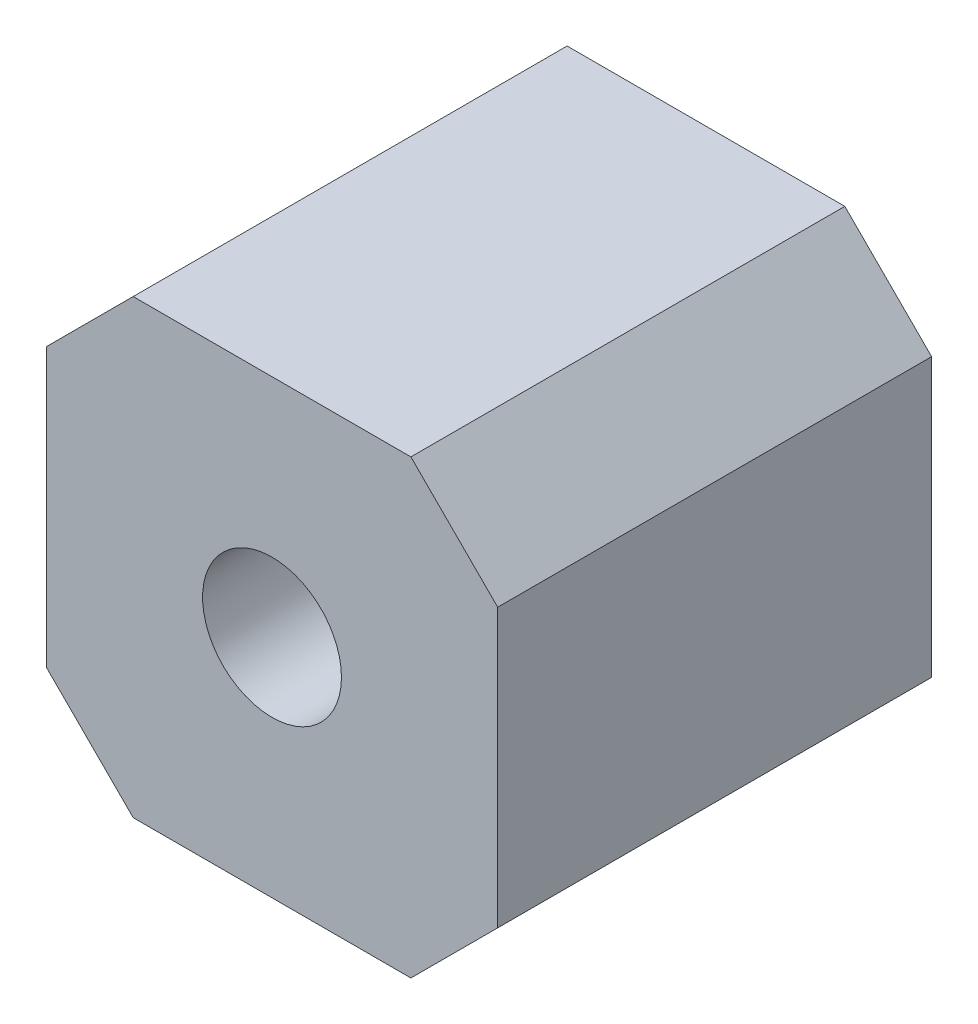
ISO-10303-21;
HEADER;
FILE_DESCRIPTION(('STEP AP214'),'2;1');
FILE_NAME('part.step','',(''),(''),'','','');
FILE_SCHEMA(('AUTOMOTIVE_DESIGN { 1 0 10303 214 1 1 1 1 }'));
ENDSEC;
DATA;
#1=APPLICATION_CONTEXT('core data for automotive mechanical design processes');
#2=APPLICATION_PROTOCOL_DEFINITION('international standard','automotive_design',2000,#1);
#3=PRODUCT_CONTEXT('',#1,'mechanical');
#4=PRODUCT('Part','Part','',(#3));
#5=PRODUCT_RELATED_PRODUCT_CATEGORY('part','',(#4));
#6=PRODUCT_DEFINITION_FORMATION('','',#4);
#7=PRODUCT_DEFINITION_CONTEXT('part definition',#1,'design');
#8=PRODUCT_DEFINITION('design','',#6,#7);
#9=PRODUCT_DEFINITION_SHAPE('','',#8);
#10=(LENGTH_UNIT() NAMED_UNIT(*) SI_UNIT(.MILLI.,.METRE.));
#11=(NAMED_UNIT(*) PLANE_ANGLE_UNIT() SI_UNIT($,.RADIAN.));
#12=(NAMED_UNIT(*) SI_UNIT($,.STERADIAN.) SOLID_ANGLE_UNIT());
#13=UNCERTAINTY_MEASURE_WITH_UNIT(LENGTH_MEASURE(1.E-05),#10,'distance_accuracy_value','');
#14=(GEOMETRIC_REPRESENTATION_CONTEXT(3) GLOBAL_UNCERTAINTY_ASSIGNED_CONTEXT((#13)) GLOBAL_UNIT_ASSIGNED_CONTEXT((#10,
#11,#12)) REPRESENTATION_CONTEXT('',''));
#15=CARTESIAN_POINT('',(0.,0.,0.));
#16=DIRECTION('',(0.,0.,1.));
#17=DIRECTION('',(1.,0.,0.));
#18=AXIS2_PLACEMENT_3D('',#15,#16,#17);
#19=CARTESIAN_POINT('',(-13.,13.,25.));
#20=DIRECTION('',(0.,0.,-1.));
#21=DIRECTION('',(-1.,0.,0.));
#22=AXIS2_PLACEMENT_3D('',#19,#20,#21);
#23=PLANE('',#22);
#24=DIRECTION('',(-1.,0.,0.));
#25=VECTOR('',#24,1.);
#26=CARTESIAN_POINT('',(-8.,13.,25.));
#27=LINE('',#26,#25);
#28=CARTESIAN_POINT('',(8.,13.,25.));
#29=VERTEX_POINT('',#28);
#30=CARTESIAN_POINT('',(-8.,13.,25.));
#31=VERTEX_POINT('',#30);
#32=EDGE_CURVE('E452',#29,#31,#27,.T.);
#33=ORIENTED_EDGE('',*,*,#32,.T.);
#34=DIRECTION('',(-0.707106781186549,-0.707106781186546,0.));
#35=VECTOR('',#34,1.);
#36=CARTESIAN_POINT('',(-13.,8.00000000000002,25.));
#37=LINE('',#36,#35);
#38=CARTESIAN_POINT('',(-13.,8.00000000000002,25.));
#39=VERTEX_POINT('',#38);
#40=EDGE_CURVE('E429',#31,#39,#37,.T.);
#41=ORIENTED_EDGE('',*,*,#40,.T.);
#42=DIRECTION('',(0.,-1.,0.));
#43=VECTOR('',#42,1.);
#44=CARTESIAN_POINT('',(-13.,8.00000000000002,25.));
#45=LINE('',#44,#43);
#46=CARTESIAN_POINT('',(-13.,-8.,25.));
#47=VERTEX_POINT('',#46);
#48=EDGE_CURVE('E455',#39,#47,#45,.T.);
#49=ORIENTED_EDGE('',*,*,#48,.T.);
#50=DIRECTION('',(0.707106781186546,-0.707106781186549,0.));
#51=VECTOR('',#50,1.);
#52=CARTESIAN_POINT('',(-13.,-8.,25.));
#53=LINE('',#52,#51);
#54=CARTESIAN_POINT('',(-8.00000000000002,-13.,25.));
#55=VERTEX_POINT('',#54);
#56=EDGE_CURVE('E457',#47,#55,#53,.T.);
#57=ORIENTED_EDGE('',*,*,#56,.T.);
#58=DIRECTION('',(1.,0.,0.));
#59=VECTOR('',#58,1.);
#60=CARTESIAN_POINT('',(-8.00000000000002,-13.,25.));
#61=LINE('',#60,#59);
#62=CARTESIAN_POINT('',(8.,-13.,25.));
#63=VERTEX_POINT('',#62);
#64=EDGE_CURVE('E459',#55,#63,#61,.T.);
#65=ORIENTED_EDGE('',*,*,#64,.T.);
#66=DIRECTION('',(0.707106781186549,0.707106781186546,0.));
#67=VECTOR('',#66,1.);
#68=CARTESIAN_POINT('',(8.,-13.,25.));
#69=LINE('',#68,#67);
#70=CARTESIAN_POINT('',(13.,-8.00000000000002,25.));
#71=VERTEX_POINT('',#70);
#72=EDGE_CURVE('E461',#63,#71,#69,.T.);
#73=ORIENTED_EDGE('',*,*,#72,.T.);
#74=DIRECTION('',(0.,1.,0.));
#75=VECTOR('',#74,1.);
#76=CARTESIAN_POINT('',(13.,8.00000000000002,25.));
#77=LINE('',#76,#75);
#78=CARTESIAN_POINT('',(13.,8.00000000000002,25.));
#79=VERTEX_POINT('',#78);
#80=EDGE_CURVE('E370',#71,#79,#77,.T.);
#81=ORIENTED_EDGE('',*,*,#80,.T.);
#82=DIRECTION('',(-0.707106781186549,0.707106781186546,0.));
#83=VECTOR('',#82,1.);
#84=CARTESIAN_POINT('',(8.,13.,25.));
#85=LINE('',#84,#83);
#86=EDGE_CURVE('E365',#79,#29,#85,.T.);
#87=ORIENTED_EDGE('',*,*,#86,.T.);
#88=EDGE_LOOP('',(#33,#41,#49,#57,#65,#73,#81,#87));
#89=FACE_BOUND('',#88,.T.);
#90=CARTESIAN_POINT('',(0.,0.,25.));
#91=DIRECTION('',(0.,0.,1.));
#92=DIRECTION('',(1.,0.,0.));
#93=AXIS2_PLACEMENT_3D('',#90,#91,#92);
#94=CIRCLE('',#93,4.);
#95=CARTESIAN_POINT('',(4.,0.,25.));
#96=VERTEX_POINT('',#95);
#97=EDGE_CURVE('E434',#96,#96,#94,.T.);
#98=ORIENTED_EDGE('',*,*,#97,.F.);
#99=EDGE_LOOP('',(#98));
#100=FACE_BOUND('',#99,.T.);
#101=ADVANCED_FACE('F350',(#89,#100),#23,.F.);
#102=CARTESIAN_POINT('',(-13.,13.,0.));
#103=DIRECTION('',(0.,0.,-1.));
#104=DIRECTION('',(-1.,0.,0.));
#105=AXIS2_PLACEMENT_3D('',#102,#103,#104);
#106=PLANE('',#105);
#107=DIRECTION('',(-1.,0.,0.));
#108=VECTOR('',#107,1.);
#109=CARTESIAN_POINT('',(-8.,13.,0.));
#110=LINE('',#109,#108);
#111=CARTESIAN_POINT('',(8.,13.,0.));
#112=VERTEX_POINT('',#111);
#113=CARTESIAN_POINT('',(-8.,13.,0.));
#114=VERTEX_POINT('',#113);
#115=EDGE_CURVE('E420',#112,#114,#110,.T.);
#116=ORIENTED_EDGE('',*,*,#115,.F.);
#117=DIRECTION('',(-0.707106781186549,0.707106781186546,0.));
#118=VECTOR('',#117,1.);
#119=CARTESIAN_POINT('',(8.,13.,0.));
#120=LINE('',#119,#118);
#121=CARTESIAN_POINT('',(13.,8.00000000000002,0.));
#122=VERTEX_POINT('',#121);
#123=EDGE_CURVE('E450',#122,#112,#120,.T.);
#124=ORIENTED_EDGE('',*,*,#123,.F.);
#125=DIRECTION('',(0.,1.,0.));
#126=VECTOR('',#125,1.);
#127=CARTESIAN_POINT('',(13.,8.00000000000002,0.));
#128=LINE('',#127,#126);
#129=CARTESIAN_POINT('',(13.,-8.00000000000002,0.));
#130=VERTEX_POINT('',#129);
#131=EDGE_CURVE('E448',#130,#122,#128,.T.);
#132=ORIENTED_EDGE('',*,*,#131,.F.);
#133=DIRECTION('',(0.707106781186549,0.707106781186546,0.));
#134=VECTOR('',#133,1.);
#135=CARTESIAN_POINT('',(8.,-13.,0.));
#136=LINE('',#135,#134);
#137=CARTESIAN_POINT('',(8.,-13.,0.));
#138=VERTEX_POINT('',#137);
#139=EDGE_CURVE('E446',#138,#130,#136,.T.);
#140=ORIENTED_EDGE('',*,*,#139,.F.);
#141=DIRECTION('',(1.,0.,0.));
#142=VECTOR('',#141,1.);
#143=CARTESIAN_POINT('',(-8.00000000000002,-13.,0.));
#144=LINE('',#143,#142);
#145=CARTESIAN_POINT('',(-8.00000000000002,-13.,0.));
#146=VERTEX_POINT('',#145);
#147=EDGE_CURVE('E444',#146,#138,#144,.T.);
#148=ORIENTED_EDGE('',*,*,#147,.F.);
#149=DIRECTION('',(0.707106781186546,-0.707106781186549,0.));
#150=VECTOR('',#149,1.);
#151=CARTESIAN_POINT('',(-13.,-8.,0.));
#152=LINE('',#151,#150);
#153=CARTESIAN_POINT('',(-13.,-8.,0.));
#154=VERTEX_POINT('',#153);
#155=EDGE_CURVE('E442',#154,#146,#152,.T.);
#156=ORIENTED_EDGE('',*,*,#155,.F.);
#157=DIRECTION('',(0.,-1.,0.));
#158=VECTOR('',#157,1.);
#159=CARTESIAN_POINT('',(-13.,8.00000000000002,0.));
#160=LINE('',#159,#158);
#161=CARTESIAN_POINT('',(-13.,8.00000000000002,0.));
#162=VERTEX_POINT('',#161);
#163=EDGE_CURVE('E422',#162,#154,#160,.T.);
#164=ORIENTED_EDGE('',*,*,#163,.F.);
#165=DIRECTION('',(-0.707106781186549,-0.707106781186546,0.));
#166=VECTOR('',#165,1.);
#167=CARTESIAN_POINT('',(-13.,8.00000000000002,0.));
#168=LINE('',#167,#166);
#169=EDGE_CURVE('E415',#114,#162,#168,.T.);
#170=ORIENTED_EDGE('',*,*,#169,.F.);
#171=EDGE_LOOP('',(#116,#124,#132,#140,#148,#156,#164,#170));
#172=FACE_BOUND('',#171,.T.);
#173=CARTESIAN_POINT('',(0.,0.,0.));
#174=DIRECTION('',(0.,0.,1.));
#175=DIRECTION('',(1.,0.,0.));
#176=AXIS2_PLACEMENT_3D('',#173,#174,#175);
#177=CIRCLE('',#176,4.);
#178=CARTESIAN_POINT('',(4.,0.,0.));
#179=VERTEX_POINT('',#178);
#180=EDGE_CURVE('E437',#179,#179,#177,.T.);
#181=ORIENTED_EDGE('',*,*,#180,.T.);
#182=EDGE_LOOP('',(#181));
#183=FACE_BOUND('',#182,.T.);
#184=ADVANCED_FACE('F416',(#172,#183),#106,.T.);
#185=CARTESIAN_POINT('',(-8.,13.,25.));
#186=DIRECTION('',(0.,-1.,0.));
#187=DIRECTION('',(0.,0.,-1.));
#188=AXIS2_PLACEMENT_3D('',#185,#186,#187);
#189=PLANE('',#188);
#190=ORIENTED_EDGE('',*,*,#115,.T.);
#191=DIRECTION('',(0.,0.,-1.));
#192=VECTOR('',#191,1.);
#193=CARTESIAN_POINT('',(-8.,13.,25.));
#194=LINE('',#193,#192);
#195=EDGE_CURVE('E11',#31,#114,#194,.T.);
#196=ORIENTED_EDGE('',*,*,#195,.F.);
#197=ORIENTED_EDGE('',*,*,#32,.F.);
#198=DIRECTION('',(0.,0.,-1.));
#199=VECTOR('',#198,1.);
#200=CARTESIAN_POINT('',(8.,13.,25.));
#201=LINE('',#200,#199);
#202=EDGE_CURVE('E433',#29,#112,#201,.T.);
#203=ORIENTED_EDGE('',*,*,#202,.T.);
#204=EDGE_LOOP('',(#190,#196,#197,#203));
#205=FACE_BOUND('',#204,.T.);
#206=ADVANCED_FACE('F352',(#205),#189,.F.);
#207=CARTESIAN_POINT('',(-13.,8.00000000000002,25.));
#208=DIRECTION('',(0.707106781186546,-0.707106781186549,0.));
#209=DIRECTION('',(0.707106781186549,0.707106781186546,0.));
#210=AXIS2_PLACEMENT_3D('',#207,#208,#209);
#211=PLANE('',#210);
#212=ORIENTED_EDGE('',*,*,#169,.T.);
#213=DIRECTION('',(0.,0.,-1.));
#214=VECTOR('',#213,1.);
#215=CARTESIAN_POINT('',(-13.,8.00000000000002,25.));
#216=LINE('',#215,#214);
#217=EDGE_CURVE('E358',#39,#162,#216,.T.);
#218=ORIENTED_EDGE('',*,*,#217,.F.);
#219=ORIENTED_EDGE('',*,*,#40,.F.);
#220=ORIENTED_EDGE('',*,*,#195,.T.);
#221=EDGE_LOOP('',(#212,#218,#219,#220));
#222=FACE_BOUND('',#221,.T.);
#223=ADVANCED_FACE('F428',(#222),#211,.F.);
#224=CARTESIAN_POINT('',(-13.,8.00000000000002,25.));
#225=DIRECTION('',(1.,0.,0.));
#226=DIRECTION('',(0.,1.,0.));
#227=AXIS2_PLACEMENT_3D('',#224,#225,#226);
#228=PLANE('',#227);
#229=ORIENTED_EDGE('',*,*,#163,.T.);
#230=DIRECTION('',(0.,0.,-1.));
#231=VECTOR('',#230,1.);
#232=CARTESIAN_POINT('',(-13.,-8.,25.));
#233=LINE('',#232,#231);
#234=EDGE_CURVE('E478',#47,#154,#233,.T.);
#235=ORIENTED_EDGE('',*,*,#234,.F.);
#236=ORIENTED_EDGE('',*,*,#48,.F.);
#237=ORIENTED_EDGE('',*,*,#217,.T.);
#238=EDGE_LOOP('',(#229,#235,#236,#237));
#239=FACE_BOUND('',#238,.T.);
#240=ADVANCED_FACE('F482',(#239),#228,.F.);
#241=CARTESIAN_POINT('',(-13.,-8.,25.));
#242=DIRECTION('',(0.707106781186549,0.707106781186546,0.));
#243=DIRECTION('',(-0.707106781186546,0.707106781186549,0.));
#244=AXIS2_PLACEMENT_3D('',#241,#242,#243);
#245=PLANE('',#244);
#246=ORIENTED_EDGE('',*,*,#155,.T.);
#247=DIRECTION('',(0.,0.,-1.));
#248=VECTOR('',#247,1.);
#249=CARTESIAN_POINT('',(-8.00000000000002,-13.,25.));
#250=LINE('',#249,#248);
#251=EDGE_CURVE('E475',#55,#146,#250,.T.);
#252=ORIENTED_EDGE('',*,*,#251,.F.);
#253=ORIENTED_EDGE('',*,*,#56,.F.);
#254=ORIENTED_EDGE('',*,*,#234,.T.);
#255=EDGE_LOOP('',(#246,#252,#253,#254));
#256=FACE_BOUND('',#255,.T.);
#257=ADVANCED_FACE('F490',(#256),#245,.F.);
#258=CARTESIAN_POINT('',(-8.00000000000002,-13.,25.));
#259=DIRECTION('',(0.,1.,0.));
#260=DIRECTION('',(0.,0.,1.));
#261=AXIS2_PLACEMENT_3D('',#258,#259,#260);
#262=PLANE('',#261);
#263=ORIENTED_EDGE('',*,*,#147,.T.);
#264=DIRECTION('',(0.,0.,-1.));
#265=VECTOR('',#264,1.);
#266=CARTESIAN_POINT('',(8.,-13.,25.));
#267=LINE('',#266,#265);
#268=EDGE_CURVE('E472',#63,#138,#267,.T.);
#269=ORIENTED_EDGE('',*,*,#268,.F.);
#270=ORIENTED_EDGE('',*,*,#64,.F.);
#271=ORIENTED_EDGE('',*,*,#251,.T.);
#272=EDGE_LOOP('',(#263,#269,#270,#271));
#273=FACE_BOUND('',#272,.T.);
#274=ADVANCED_FACE('F493',(#273),#262,.F.);
#275=CARTESIAN_POINT('',(8.,-13.,25.));
#276=DIRECTION('',(-0.707106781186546,0.707106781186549,0.));
#277=DIRECTION('',(-0.707106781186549,-0.707106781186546,0.));
#278=AXIS2_PLACEMENT_3D('',#275,#276,#277);
#279=PLANE('',#278);
#280=ORIENTED_EDGE('',*,*,#139,.T.);
#281=DIRECTION('',(0.,0.,-1.));
#282=VECTOR('',#281,1.);
#283=CARTESIAN_POINT('',(13.,-8.00000000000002,25.));
#284=LINE('',#283,#282);
#285=EDGE_CURVE('E469',#71,#130,#284,.T.);
#286=ORIENTED_EDGE('',*,*,#285,.F.);
#287=ORIENTED_EDGE('',*,*,#72,.F.);
#288=ORIENTED_EDGE('',*,*,#268,.T.);
#289=EDGE_LOOP('',(#280,#286,#287,#288));
#290=FACE_BOUND('',#289,.T.);
#291=ADVANCED_FACE('F498',(#290),#279,.F.);
#292=CARTESIAN_POINT('',(13.,8.00000000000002,25.));
#293=DIRECTION('',(-1.,0.,0.));
#294=DIRECTION('',(0.,-1.,0.));
#295=AXIS2_PLACEMENT_3D('',#292,#293,#294);
#296=PLANE('',#295);
#297=ORIENTED_EDGE('',*,*,#131,.T.);
#298=DIRECTION('',(0.,0.,-1.));
#299=VECTOR('',#298,1.);
#300=CARTESIAN_POINT('',(13.,8.00000000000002,25.));
#301=LINE('',#300,#299);
#302=EDGE_CURVE('E466',#79,#122,#301,.T.);
#303=ORIENTED_EDGE('',*,*,#302,.F.);
#304=ORIENTED_EDGE('',*,*,#80,.F.);
#305=ORIENTED_EDGE('',*,*,#285,.T.);
#306=EDGE_LOOP('',(#297,#303,#304,#305));
#307=FACE_BOUND('',#306,.T.);
#308=ADVANCED_FACE('F501',(#307),#296,.F.);
#309=CARTESIAN_POINT('',(8.,13.,25.));
#310=DIRECTION('',(-0.707106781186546,-0.707106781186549,0.));
#311=DIRECTION('',(0.707106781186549,-0.707106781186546,0.));
#312=AXIS2_PLACEMENT_3D('',#309,#310,#311);
#313=PLANE('',#312);
#314=ORIENTED_EDGE('',*,*,#123,.T.);
#315=ORIENTED_EDGE('',*,*,#202,.F.);
#316=ORIENTED_EDGE('',*,*,#86,.F.);
#317=ORIENTED_EDGE('',*,*,#302,.T.);
#318=EDGE_LOOP('',(#314,#315,#316,#317));
#319=FACE_BOUND('',#318,.T.);
#320=ADVANCED_FACE('F503',(#319),#313,.F.);
#321=CARTESIAN_POINT('',(0.,0.,25.));
#322=DIRECTION('',(0.,0.,-1.));
#323=DIRECTION('',(-1.,0.,0.));
#324=AXIS2_PLACEMENT_3D('',#321,#322,#323);
#325=CYLINDRICAL_SURFACE('',#324,4.);
#326=ORIENTED_EDGE('',*,*,#97,.T.);
#327=EDGE_LOOP('',(#326));
#328=FACE_BOUND('',#327,.T.);
#329=ORIENTED_EDGE('',*,*,#180,.F.);
#330=EDGE_LOOP('',(#329));
#331=FACE_BOUND('',#330,.T.);
#332=ADVANCED_FACE('F505',(#328,#331),#325,.F.);
#333=CLOSED_SHELL('',(#101,#184,#206,#223,#240,#257,#274,#291,#308,#320,#332));
#334=MANIFOLD_SOLID_BREP('B2',#333);
#335=ADVANCED_BREP_SHAPE_REPRESENTATION('',(#18,#334),#14);
#336=SHAPE_DEFINITION_REPRESENTATION(#9,#335);
ENDSEC;
END-ISO-10303-21;
